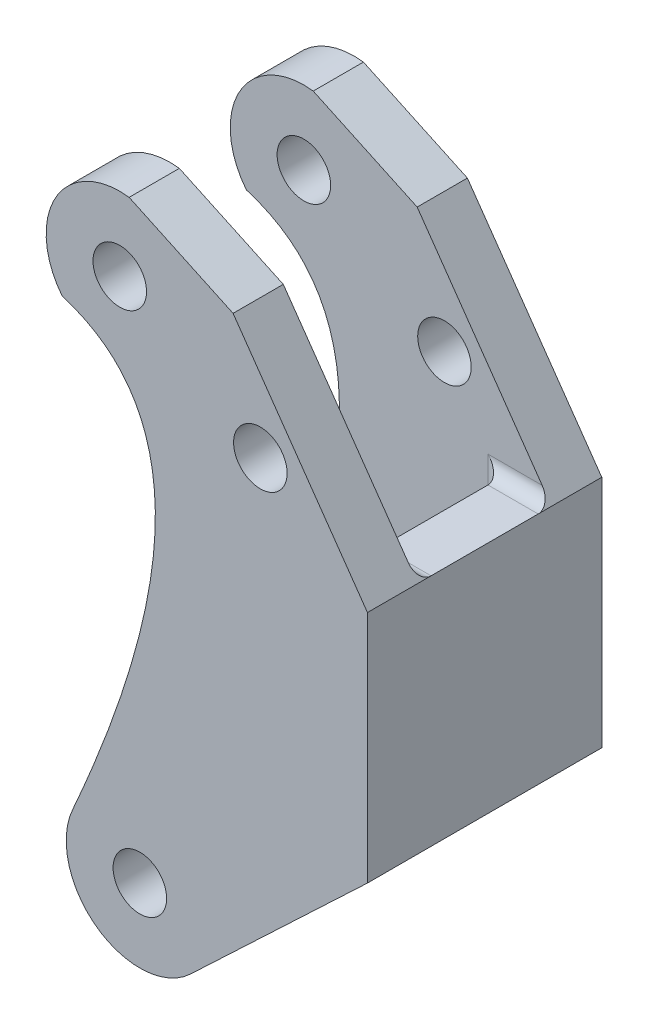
from build123d import *

# Parameters (mm, degrees)
EXTRUSION1_DEPTH        = 35
ESQUISSE3_W             = 20
ESQUISSE3_H             = 39.772251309
ESQUISSE3_H_2           = 28.595906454
ENL_V_MAT_EXTRU_1_DEPTH = 93.574294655
ESQUISSE4_W             = 33.734650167
ESQUISSE4_H             = 20
ENL_V_MAT_EXTRU_2_DEPTH = 93.574294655
ESQUISSE5_R             = 4
ENL_V_MAT_EXTRU_3_DEPTH = 93.574294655
CONG_1_R                = 2
ESQUISSE6_R             = 4
ENL_V_MAT_EXTRU_4_DEPTH = 93.574294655
EXTRUSION2_REACH        = 94.574
EXTRUSION2_END_RADIUS   = 4
ESQUISSE7_R             = 2.5


with BuildPart() as part:
    # Esquisse1 → Extrusion1 (new body)
    with BuildSketch(Plane.XY):
        with BuildLine():
            Line((0, 0), (0, 35))
            Line((0, 35), (-20.075175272, 63.67032155))
            Line((-20.075175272, 63.67032155), (-35.602600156, 70.910878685))
            ThreePointArc((-35.602600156, 70.910878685), (-46.589935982, 65.388239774), (-45.592143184, 53.131588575))
            add(Edge.make_bspline(
                [(-45.592143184, 53.131588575), (-18.585401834, 44.918858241), (-44.033482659, -12.491205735)],
                knots=[0, 0, 0, 1, 1, 1], degree=2))
            ThreePointArc((-44.033482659, -12.491205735), (-40.373066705, -25.965713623), (-26.444059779, -24.994233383))
            Line((-26.444059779, -24.994233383), (0, 0))
        make_face()
    extrude(amount=EXTRUSION1_DEPTH)

    # Esquisse3 → Enl_v. mat.-Extru.1 (cut, through all)
    with BuildSketch(Plane(origin=(0, 0, 0), x_dir=(0, 0, -1), z_dir=(1, 0, 0))):
        with Locations((-17.5, 54.886125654)):
            Rectangle(ESQUISSE3_W, ESQUISSE3_H)
        with Locations((-17.5, -14.297953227)):
            Rectangle(ESQUISSE3_W, ESQUISSE3_H_2)
    extrude(amount=-ENL_V_MAT_EXTRU_1_DEPTH, mode=Mode.SUBTRACT)

    # Esquisse4 → Enl_v. mat.-Extru.2 (cut, through all)
    with BuildSketch(Plane.XZ):
        with Locations((-24.367325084, 17.5)):
            Rectangle(ESQUISSE4_W, ESQUISSE4_H)
    extrude(amount=-ENL_V_MAT_EXTRU_2_DEPTH, mode=Mode.SUBTRACT)

    # Esquisse5 → Enl_v. mat.-Extru.3 (cut, through all)
    with BuildSketch(Plane(origin=(0, 0, 0), x_dir=(-1, 0, 0), z_dir=(0, 0, -1))):
        with Locations((37, 60)):
            Circle(ESQUISSE5_R)
        with Locations((34, -17)):
            Circle(ESQUISSE5_R)
    extrude(amount=-ENL_V_MAT_EXTRU_3_DEPTH, mode=Mode.SUBTRACT)

    # Cong_1
    cong_1_edges = [part.edges().sort_by_distance(p)[0] for p in [
        (-3.75, 0, 7.5),
        (-3.75, 0, 27.5),
        (-3.75, 35, 27.5),
        (-3.75, 35, 7.5),
        (-7.5, 17.5, 27.5),
        (-7.5, 17.5, 7.5),
    ]]
    fillet(cong_1_edges, radius=CONG_1_R)

    # Esquisse6 → Enl_v. mat.-Extru.4 (cut, through all)
    with BuildSketch(Plane.XY.offset(35)):
        with Locations((-16, 47)):
            Circle(ESQUISSE6_R)
    extrude(amount=-ENL_V_MAT_EXTRU_4_DEPTH, mode=Mode.SUBTRACT)

    # Extrusion2: up to this cylinder (the profile starts outside it)
    extrusion2_end = Plane(origin=(-34, -17, 3.75), z_dir=(0, 0, -1)) * Cylinder(EXTRUSION2_END_RADIUS, 198.148, mode=Mode.PRIVATE)
    # Esquisse7 → Extrusion2 (cut, up to the surface)
    with BuildSketch(Plane(origin=(0, 0, 0), x_dir=(0.7267484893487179, 0.6869036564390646, 0), z_dir=(0.6869036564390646, -0.7267484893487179, 0)), mode=Mode.PRIVATE) as extrusion2_sk1:
        with Locations((-36.386810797, 3.75)):
            Circle(ESQUISSE7_R)
    extrusion2_tool1 = extrude(extrusion2_sk1.sketch, amount=-EXTRUSION2_REACH, mode=Mode.PRIVATE) - extrusion2_end
    add(extrusion2_tool1.solids().sort_by_distance((-26.44406, -24.994233, 3.75))[0], mode=Mode.SUBTRACT)


solid = part.part
